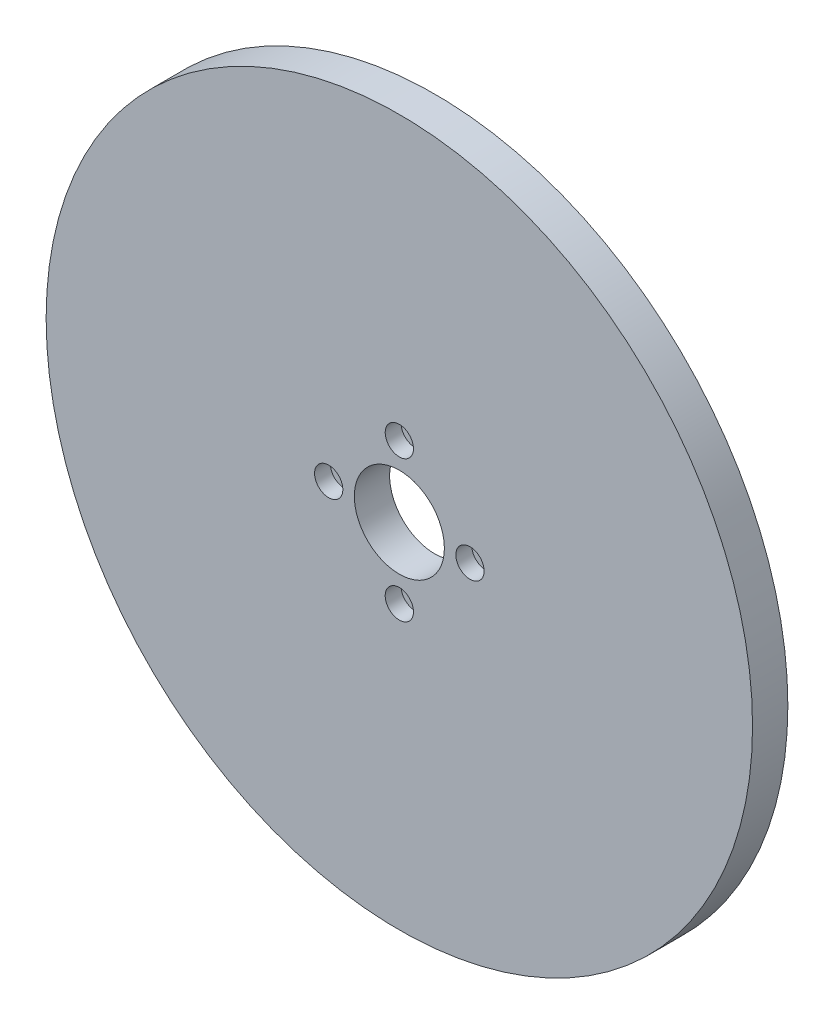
ISO-10303-21;
HEADER;
FILE_DESCRIPTION(('STEP AP214'),'2;1');
FILE_NAME('part.step','',(''),(''),'','','');
FILE_SCHEMA(('AUTOMOTIVE_DESIGN { 1 0 10303 214 1 1 1 1 }'));
ENDSEC;
DATA;
#1=APPLICATION_CONTEXT('core data for automotive mechanical design processes');
#2=APPLICATION_PROTOCOL_DEFINITION('international standard','automotive_design',2000,#1);
#3=PRODUCT_CONTEXT('',#1,'mechanical');
#4=PRODUCT('Part','Part','',(#3));
#5=PRODUCT_RELATED_PRODUCT_CATEGORY('part','',(#4));
#6=PRODUCT_DEFINITION_FORMATION('','',#4);
#7=PRODUCT_DEFINITION_CONTEXT('part definition',#1,'design');
#8=PRODUCT_DEFINITION('design','',#6,#7);
#9=PRODUCT_DEFINITION_SHAPE('','',#8);
#10=(LENGTH_UNIT() NAMED_UNIT(*) SI_UNIT(.MILLI.,.METRE.));
#11=(NAMED_UNIT(*) PLANE_ANGLE_UNIT() SI_UNIT($,.RADIAN.));
#12=(NAMED_UNIT(*) SI_UNIT($,.STERADIAN.) SOLID_ANGLE_UNIT());
#13=UNCERTAINTY_MEASURE_WITH_UNIT(LENGTH_MEASURE(1.E-05),#10,'distance_accuracy_value','');
#14=(GEOMETRIC_REPRESENTATION_CONTEXT(3) GLOBAL_UNCERTAINTY_ASSIGNED_CONTEXT((#13)) GLOBAL_UNIT_ASSIGNED_CONTEXT((#10,
#11,#12)) REPRESENTATION_CONTEXT('',''));
#15=CARTESIAN_POINT('',(0.,0.,0.));
#16=DIRECTION('',(0.,0.,1.));
#17=DIRECTION('',(1.,0.,0.));
#18=AXIS2_PLACEMENT_3D('',#15,#16,#17);
#19=CARTESIAN_POINT('',(0.,19.9999999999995,10.));
#20=DIRECTION('',(0.,0.,-1.));
#21=DIRECTION('',(-1.,0.,0.));
#22=AXIS2_PLACEMENT_3D('',#19,#20,#21);
#23=CYLINDRICAL_SURFACE('',#22,2.25);
#24=CARTESIAN_POINT('',(0.,19.9999999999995,0.));
#25=DIRECTION('',(0.,0.,1.));
#26=DIRECTION('',(1.,0.,0.));
#27=AXIS2_PLACEMENT_3D('',#24,#25,#26);
#28=CIRCLE('',#27,2.25);
#29=CARTESIAN_POINT('',(2.25,19.9999999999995,0.));
#30=VERTEX_POINT('',#29);
#31=EDGE_CURVE('E52',#30,#30,#28,.T.);
#32=ORIENTED_EDGE('',*,*,#31,.F.);
#33=EDGE_LOOP('',(#32));
#34=FACE_BOUND('',#33,.T.);
#35=CARTESIAN_POINT('',(0.,19.9999999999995,5.5));
#36=DIRECTION('',(0.,0.,1.));
#37=DIRECTION('',(1.,0.,0.));
#38=AXIS2_PLACEMENT_3D('',#35,#36,#37);
#39=CIRCLE('',#38,2.25);
#40=CARTESIAN_POINT('',(2.25,19.9999999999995,5.5));
#41=VERTEX_POINT('',#40);
#42=EDGE_CURVE('E34',#41,#41,#39,.T.);
#43=ORIENTED_EDGE('',*,*,#42,.T.);
#44=EDGE_LOOP('',(#43));
#45=FACE_BOUND('',#44,.T.);
#46=ADVANCED_FACE('F30',(#34,#45),#23,.F.);
#47=CARTESIAN_POINT('',(-20.,1.36424205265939E-12,10.));
#48=DIRECTION('',(0.,0.,-1.));
#49=DIRECTION('',(-1.,0.,0.));
#50=AXIS2_PLACEMENT_3D('',#47,#48,#49);
#51=CYLINDRICAL_SURFACE('',#50,2.25);
#52=CARTESIAN_POINT('',(-20.,1.36424205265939E-12,0.));
#53=DIRECTION('',(0.,0.,1.));
#54=DIRECTION('',(1.,0.,0.));
#55=AXIS2_PLACEMENT_3D('',#52,#53,#54);
#56=CIRCLE('',#55,2.25);
#57=CARTESIAN_POINT('',(-17.75,1.36424205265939E-12,0.));
#58=VERTEX_POINT('',#57);
#59=EDGE_CURVE('E85',#58,#58,#56,.T.);
#60=ORIENTED_EDGE('',*,*,#59,.F.);
#61=EDGE_LOOP('',(#60));
#62=FACE_BOUND('',#61,.T.);
#63=CARTESIAN_POINT('',(-20.,1.36424205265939E-12,5.5));
#64=DIRECTION('',(0.,0.,1.));
#65=DIRECTION('',(1.,0.,0.));
#66=AXIS2_PLACEMENT_3D('',#63,#64,#65);
#67=CIRCLE('',#66,2.25);
#68=CARTESIAN_POINT('',(-17.75,1.36424205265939E-12,5.5));
#69=VERTEX_POINT('',#68);
#70=EDGE_CURVE('E58',#69,#69,#67,.T.);
#71=ORIENTED_EDGE('',*,*,#70,.T.);
#72=EDGE_LOOP('',(#71));
#73=FACE_BOUND('',#72,.T.);
#74=ADVANCED_FACE('F117',(#62,#73),#51,.F.);
#75=CARTESIAN_POINT('',(0.,-20.0000000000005,10.));
#76=DIRECTION('',(0.,0.,-1.));
#77=DIRECTION('',(-1.,0.,0.));
#78=AXIS2_PLACEMENT_3D('',#75,#76,#77);
#79=CYLINDRICAL_SURFACE('',#78,2.25);
#80=CARTESIAN_POINT('',(0.,-20.0000000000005,0.));
#81=DIRECTION('',(0.,0.,1.));
#82=DIRECTION('',(1.,0.,0.));
#83=AXIS2_PLACEMENT_3D('',#80,#81,#82);
#84=CIRCLE('',#83,2.25);
#85=CARTESIAN_POINT('',(2.25,-20.0000000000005,0.));
#86=VERTEX_POINT('',#85);
#87=EDGE_CURVE('E88',#86,#86,#84,.T.);
#88=ORIENTED_EDGE('',*,*,#87,.F.);
#89=EDGE_LOOP('',(#88));
#90=FACE_BOUND('',#89,.T.);
#91=CARTESIAN_POINT('',(0.,-20.0000000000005,5.5));
#92=DIRECTION('',(0.,0.,1.));
#93=DIRECTION('',(1.,0.,0.));
#94=AXIS2_PLACEMENT_3D('',#91,#92,#93);
#95=CIRCLE('',#94,2.25);
#96=CARTESIAN_POINT('',(2.25,-20.0000000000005,5.5));
#97=VERTEX_POINT('',#96);
#98=EDGE_CURVE('E54',#97,#97,#95,.T.);
#99=ORIENTED_EDGE('',*,*,#98,.T.);
#100=EDGE_LOOP('',(#99));
#101=FACE_BOUND('',#100,.T.);
#102=ADVANCED_FACE('F123',(#90,#101),#79,.F.);
#103=CARTESIAN_POINT('',(20.,1.36424205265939E-12,10.));
#104=DIRECTION('',(0.,0.,-1.));
#105=DIRECTION('',(-1.,0.,0.));
#106=AXIS2_PLACEMENT_3D('',#103,#104,#105);
#107=CYLINDRICAL_SURFACE('',#106,2.25);
#108=CARTESIAN_POINT('',(20.,1.36424205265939E-12,0.));
#109=DIRECTION('',(0.,0.,1.));
#110=DIRECTION('',(1.,0.,0.));
#111=AXIS2_PLACEMENT_3D('',#108,#109,#110);
#112=CIRCLE('',#111,2.25);
#113=CARTESIAN_POINT('',(22.25,1.36424205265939E-12,0.));
#114=VERTEX_POINT('',#113);
#115=EDGE_CURVE('E91',#114,#114,#112,.T.);
#116=ORIENTED_EDGE('',*,*,#115,.F.);
#117=EDGE_LOOP('',(#116));
#118=FACE_BOUND('',#117,.T.);
#119=CARTESIAN_POINT('',(20.,1.36424205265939E-12,5.5));
#120=DIRECTION('',(0.,0.,1.));
#121=DIRECTION('',(1.,0.,0.));
#122=AXIS2_PLACEMENT_3D('',#119,#120,#121);
#123=CIRCLE('',#122,2.25);
#124=CARTESIAN_POINT('',(22.25,1.36424205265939E-12,5.5));
#125=VERTEX_POINT('',#124);
#126=EDGE_CURVE('E49',#125,#125,#123,.T.);
#127=ORIENTED_EDGE('',*,*,#126,.T.);
#128=EDGE_LOOP('',(#127));
#129=FACE_BOUND('',#128,.T.);
#130=ADVANCED_FACE('F131',(#118,#129),#107,.F.);
#131=CARTESIAN_POINT('',(0.,1.36424205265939E-12,10.));
#132=DIRECTION('',(0.,0.,1.));
#133=DIRECTION('',(1.,0.,0.));
#134=AXIS2_PLACEMENT_3D('',#131,#132,#133);
#135=PLANE('',#134);
#136=CARTESIAN_POINT('',(0.,19.9999999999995,10.));
#137=DIRECTION('',(0.,0.,1.));
#138=DIRECTION('',(1.,0.,0.));
#139=AXIS2_PLACEMENT_3D('',#136,#137,#138);
#140=CIRCLE('',#139,4.);
#141=CARTESIAN_POINT('',(4.,19.9999999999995,10.));
#142=VERTEX_POINT('',#141);
#143=EDGE_CURVE('E74',#142,#142,#140,.T.);
#144=ORIENTED_EDGE('',*,*,#143,.F.);
#145=EDGE_LOOP('',(#144));
#146=FACE_BOUND('',#145,.T.);
#147=CARTESIAN_POINT('',(-20.,1.36424205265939E-12,10.));
#148=DIRECTION('',(0.,0.,1.));
#149=DIRECTION('',(1.,0.,0.));
#150=AXIS2_PLACEMENT_3D('',#147,#148,#149);
#151=CIRCLE('',#150,4.);
#152=CARTESIAN_POINT('',(-16.,1.36424205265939E-12,10.));
#153=VERTEX_POINT('',#152);
#154=EDGE_CURVE('E67',#153,#153,#151,.T.);
#155=ORIENTED_EDGE('',*,*,#154,.F.);
#156=EDGE_LOOP('',(#155));
#157=FACE_BOUND('',#156,.T.);
#158=CARTESIAN_POINT('',(0.,-20.0000000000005,10.));
#159=DIRECTION('',(0.,0.,1.));
#160=DIRECTION('',(1.,0.,0.));
#161=AXIS2_PLACEMENT_3D('',#158,#159,#160);
#162=CIRCLE('',#161,4.);
#163=CARTESIAN_POINT('',(4.,-20.0000000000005,10.));
#164=VERTEX_POINT('',#163);
#165=EDGE_CURVE('E60',#164,#164,#162,.T.);
#166=ORIENTED_EDGE('',*,*,#165,.F.);
#167=EDGE_LOOP('',(#166));
#168=FACE_BOUND('',#167,.T.);
#169=CARTESIAN_POINT('',(20.,1.36424205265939E-12,10.));
#170=DIRECTION('',(0.,0.,1.));
#171=DIRECTION('',(1.,0.,0.));
#172=AXIS2_PLACEMENT_3D('',#169,#170,#171);
#173=CIRCLE('',#172,4.);
#174=CARTESIAN_POINT('',(24.,1.36424205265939E-12,10.));
#175=VERTEX_POINT('',#174);
#176=EDGE_CURVE('E56',#175,#175,#173,.T.);
#177=ORIENTED_EDGE('',*,*,#176,.F.);
#178=EDGE_LOOP('',(#177));
#179=FACE_BOUND('',#178,.T.);
#180=CARTESIAN_POINT('',(0.,1.36424205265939E-12,10.));
#181=DIRECTION('',(0.,0.,1.));
#182=DIRECTION('',(1.,0.,0.));
#183=AXIS2_PLACEMENT_3D('',#180,#181,#182);
#184=CIRCLE('',#183,100.);
#185=CARTESIAN_POINT('',(100.,1.36424205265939E-12,10.));
#186=VERTEX_POINT('',#185);
#187=EDGE_CURVE('E10',#186,#186,#184,.T.);
#188=ORIENTED_EDGE('',*,*,#187,.T.);
#189=EDGE_LOOP('',(#188));
#190=FACE_BOUND('',#189,.T.);
#191=CARTESIAN_POINT('',(0.,1.36424205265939E-12,10.));
#192=DIRECTION('',(0.,0.,1.));
#193=DIRECTION('',(1.,0.,0.));
#194=AXIS2_PLACEMENT_3D('',#191,#192,#193);
#195=CIRCLE('',#194,12.75);
#196=CARTESIAN_POINT('',(12.75,1.36424205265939E-12,10.));
#197=VERTEX_POINT('',#196);
#198=EDGE_CURVE('E43',#197,#197,#195,.T.);
#199=ORIENTED_EDGE('',*,*,#198,.F.);
#200=EDGE_LOOP('',(#199));
#201=FACE_BOUND('',#200,.T.);
#202=ADVANCED_FACE('F134',(#146,#157,#168,#179,#190,#201),#135,.T.);
#203=CARTESIAN_POINT('',(0.,1.36424205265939E-12,0.));
#204=DIRECTION('',(0.,0.,1.));
#205=DIRECTION('',(1.,0.,0.));
#206=AXIS2_PLACEMENT_3D('',#203,#204,#205);
#207=PLANE('',#206);
#208=ORIENTED_EDGE('',*,*,#59,.T.);
#209=EDGE_LOOP('',(#208));
#210=FACE_BOUND('',#209,.T.);
#211=ORIENTED_EDGE('',*,*,#115,.T.);
#212=EDGE_LOOP('',(#211));
#213=FACE_BOUND('',#212,.T.);
#214=CARTESIAN_POINT('',(0.,1.36424205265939E-12,0.));
#215=DIRECTION('',(0.,0.,1.));
#216=DIRECTION('',(1.,0.,0.));
#217=AXIS2_PLACEMENT_3D('',#214,#215,#216);
#218=CIRCLE('',#217,100.);
#219=CARTESIAN_POINT('',(100.,1.36424205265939E-12,0.));
#220=VERTEX_POINT('',#219);
#221=EDGE_CURVE('E38',#220,#220,#218,.T.);
#222=ORIENTED_EDGE('',*,*,#221,.F.);
#223=EDGE_LOOP('',(#222));
#224=FACE_BOUND('',#223,.T.);
#225=CARTESIAN_POINT('',(0.,1.36424205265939E-12,0.));
#226=DIRECTION('',(0.,0.,1.));
#227=DIRECTION('',(1.,0.,0.));
#228=AXIS2_PLACEMENT_3D('',#225,#226,#227);
#229=CIRCLE('',#228,12.75);
#230=CARTESIAN_POINT('',(12.75,1.36424205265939E-12,0.));
#231=VERTEX_POINT('',#230);
#232=EDGE_CURVE('E46',#231,#231,#229,.T.);
#233=ORIENTED_EDGE('',*,*,#232,.T.);
#234=EDGE_LOOP('',(#233));
#235=FACE_BOUND('',#234,.T.);
#236=ORIENTED_EDGE('',*,*,#87,.T.);
#237=EDGE_LOOP('',(#236));
#238=FACE_BOUND('',#237,.T.);
#239=ORIENTED_EDGE('',*,*,#31,.T.);
#240=EDGE_LOOP('',(#239));
#241=FACE_BOUND('',#240,.T.);
#242=ADVANCED_FACE('F99',(#210,#213,#224,#235,#238,#241),#207,.F.);
#243=CARTESIAN_POINT('',(0.,1.36424205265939E-12,10.));
#244=DIRECTION('',(0.,0.,-1.));
#245=DIRECTION('',(-1.,0.,0.));
#246=AXIS2_PLACEMENT_3D('',#243,#244,#245);
#247=CYLINDRICAL_SURFACE('',#246,100.);
#248=ORIENTED_EDGE('',*,*,#187,.F.);
#249=EDGE_LOOP('',(#248));
#250=FACE_BOUND('',#249,.T.);
#251=ORIENTED_EDGE('',*,*,#221,.T.);
#252=EDGE_LOOP('',(#251));
#253=FACE_BOUND('',#252,.T.);
#254=ADVANCED_FACE('F32',(#250,#253),#247,.T.);
#255=CARTESIAN_POINT('',(0.,1.36424205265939E-12,10.));
#256=DIRECTION('',(0.,0.,-1.));
#257=DIRECTION('',(-1.,0.,0.));
#258=AXIS2_PLACEMENT_3D('',#255,#256,#257);
#259=CYLINDRICAL_SURFACE('',#258,12.75);
#260=ORIENTED_EDGE('',*,*,#198,.T.);
#261=EDGE_LOOP('',(#260));
#262=FACE_BOUND('',#261,.T.);
#263=ORIENTED_EDGE('',*,*,#232,.F.);
#264=EDGE_LOOP('',(#263));
#265=FACE_BOUND('',#264,.T.);
#266=ADVANCED_FACE('F102',(#262,#265),#259,.F.);
#267=CARTESIAN_POINT('',(20.,1.36424205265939E-12,5.5));
#268=DIRECTION('',(0.,0.,1.));
#269=DIRECTION('',(1.,0.,0.));
#270=AXIS2_PLACEMENT_3D('',#267,#268,#269);
#271=CYLINDRICAL_SURFACE('',#270,4.);
#272=CARTESIAN_POINT('',(20.,1.36424205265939E-12,5.5));
#273=DIRECTION('',(0.,0.,1.));
#274=DIRECTION('',(1.,0.,0.));
#275=AXIS2_PLACEMENT_3D('',#272,#273,#274);
#276=CIRCLE('',#275,4.);
#277=CARTESIAN_POINT('',(24.,1.36424205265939E-12,5.5));
#278=VERTEX_POINT('',#277);
#279=EDGE_CURVE('E53',#278,#278,#276,.T.);
#280=ORIENTED_EDGE('',*,*,#279,.F.);
#281=EDGE_LOOP('',(#280));
#282=FACE_BOUND('',#281,.T.);
#283=ORIENTED_EDGE('',*,*,#176,.T.);
#284=EDGE_LOOP('',(#283));
#285=FACE_BOUND('',#284,.T.);
#286=ADVANCED_FACE('F104',(#282,#285),#271,.F.);
#287=CARTESIAN_POINT('',(20.,1.36424205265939E-12,5.5));
#288=DIRECTION('',(0.,0.,1.));
#289=DIRECTION('',(1.,0.,0.));
#290=AXIS2_PLACEMENT_3D('',#287,#288,#289);
#291=PLANE('',#290);
#292=ORIENTED_EDGE('',*,*,#126,.F.);
#293=EDGE_LOOP('',(#292));
#294=FACE_BOUND('',#293,.T.);
#295=ORIENTED_EDGE('',*,*,#279,.T.);
#296=EDGE_LOOP('',(#295));
#297=FACE_BOUND('',#296,.T.);
#298=ADVANCED_FACE('F110',(#294,#297),#291,.T.);
#299=CARTESIAN_POINT('',(0.,-20.0000000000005,5.5));
#300=DIRECTION('',(0.,0.,1.));
#301=DIRECTION('',(1.,0.,0.));
#302=AXIS2_PLACEMENT_3D('',#299,#300,#301);
#303=CYLINDRICAL_SURFACE('',#302,4.);
#304=CARTESIAN_POINT('',(0.,-20.0000000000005,5.5));
#305=DIRECTION('',(0.,0.,1.));
#306=DIRECTION('',(1.,0.,0.));
#307=AXIS2_PLACEMENT_3D('',#304,#305,#306);
#308=CIRCLE('',#307,4.);
#309=CARTESIAN_POINT('',(4.,-20.0000000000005,5.5));
#310=VERTEX_POINT('',#309);
#311=EDGE_CURVE('E57',#310,#310,#308,.T.);
#312=ORIENTED_EDGE('',*,*,#311,.F.);
#313=EDGE_LOOP('',(#312));
#314=FACE_BOUND('',#313,.T.);
#315=ORIENTED_EDGE('',*,*,#165,.T.);
#316=EDGE_LOOP('',(#315));
#317=FACE_BOUND('',#316,.T.);
#318=ADVANCED_FACE('F146',(#314,#317),#303,.F.);
#319=CARTESIAN_POINT('',(0.,-20.0000000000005,5.5));
#320=DIRECTION('',(0.,0.,1.));
#321=DIRECTION('',(1.,0.,0.));
#322=AXIS2_PLACEMENT_3D('',#319,#320,#321);
#323=PLANE('',#322);
#324=ORIENTED_EDGE('',*,*,#98,.F.);
#325=EDGE_LOOP('',(#324));
#326=FACE_BOUND('',#325,.T.);
#327=ORIENTED_EDGE('',*,*,#311,.T.);
#328=EDGE_LOOP('',(#327));
#329=FACE_BOUND('',#328,.T.);
#330=ADVANCED_FACE('F155',(#326,#329),#323,.T.);
#331=CARTESIAN_POINT('',(-20.,1.36424205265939E-12,5.5));
#332=DIRECTION('',(0.,0.,1.));
#333=DIRECTION('',(1.,0.,0.));
#334=AXIS2_PLACEMENT_3D('',#331,#332,#333);
#335=CYLINDRICAL_SURFACE('',#334,4.);
#336=CARTESIAN_POINT('',(-20.,1.36424205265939E-12,5.5));
#337=DIRECTION('',(0.,0.,1.));
#338=DIRECTION('',(1.,0.,0.));
#339=AXIS2_PLACEMENT_3D('',#336,#337,#338);
#340=CIRCLE('',#339,4.);
#341=CARTESIAN_POINT('',(-16.,1.36424205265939E-12,5.5));
#342=VERTEX_POINT('',#341);
#343=EDGE_CURVE('E61',#342,#342,#340,.T.);
#344=ORIENTED_EDGE('',*,*,#343,.F.);
#345=EDGE_LOOP('',(#344));
#346=FACE_BOUND('',#345,.T.);
#347=ORIENTED_EDGE('',*,*,#154,.T.);
#348=EDGE_LOOP('',(#347));
#349=FACE_BOUND('',#348,.T.);
#350=ADVANCED_FACE('F161',(#346,#349),#335,.F.);
#351=CARTESIAN_POINT('',(-20.,1.36424205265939E-12,5.5));
#352=DIRECTION('',(0.,0.,1.));
#353=DIRECTION('',(1.,0.,0.));
#354=AXIS2_PLACEMENT_3D('',#351,#352,#353);
#355=PLANE('',#354);
#356=ORIENTED_EDGE('',*,*,#70,.F.);
#357=EDGE_LOOP('',(#356));
#358=FACE_BOUND('',#357,.T.);
#359=ORIENTED_EDGE('',*,*,#343,.T.);
#360=EDGE_LOOP('',(#359));
#361=FACE_BOUND('',#360,.T.);
#362=ADVANCED_FACE('F165',(#358,#361),#355,.T.);
#363=CARTESIAN_POINT('',(0.,19.9999999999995,5.5));
#364=DIRECTION('',(0.,0.,1.));
#365=DIRECTION('',(1.,0.,0.));
#366=AXIS2_PLACEMENT_3D('',#363,#364,#365);
#367=CYLINDRICAL_SURFACE('',#366,4.);
#368=CARTESIAN_POINT('',(0.,19.9999999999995,5.5));
#369=DIRECTION('',(0.,0.,1.));
#370=DIRECTION('',(1.,0.,0.));
#371=AXIS2_PLACEMENT_3D('',#368,#369,#370);
#372=CIRCLE('',#371,4.);
#373=CARTESIAN_POINT('',(4.,19.9999999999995,5.5));
#374=VERTEX_POINT('',#373);
#375=EDGE_CURVE('E184',#374,#374,#372,.T.);
#376=ORIENTED_EDGE('',*,*,#375,.F.);
#377=EDGE_LOOP('',(#376));
#378=FACE_BOUND('',#377,.T.);
#379=ORIENTED_EDGE('',*,*,#143,.T.);
#380=EDGE_LOOP('',(#379));
#381=FACE_BOUND('',#380,.T.);
#382=ADVANCED_FACE('F169',(#378,#381),#367,.F.);
#383=CARTESIAN_POINT('',(0.,19.9999999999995,5.5));
#384=DIRECTION('',(0.,0.,1.));
#385=DIRECTION('',(1.,0.,0.));
#386=AXIS2_PLACEMENT_3D('',#383,#384,#385);
#387=PLANE('',#386);
#388=ORIENTED_EDGE('',*,*,#42,.F.);
#389=EDGE_LOOP('',(#388));
#390=FACE_BOUND('',#389,.T.);
#391=ORIENTED_EDGE('',*,*,#375,.T.);
#392=EDGE_LOOP('',(#391));
#393=FACE_BOUND('',#392,.T.);
#394=ADVANCED_FACE('F173',(#390,#393),#387,.T.);
#395=CLOSED_SHELL('',(#46,#74,#102,#130,#202,#242,#254,#266,#286,#298,#318,#330,#350,#362,#382,#394));
#396=MANIFOLD_SOLID_BREP('B2',#395);
#397=ADVANCED_BREP_SHAPE_REPRESENTATION('',(#18,#396),#14);
#398=SHAPE_DEFINITION_REPRESENTATION(#9,#397);
ENDSEC;
END-ISO-10303-21;
